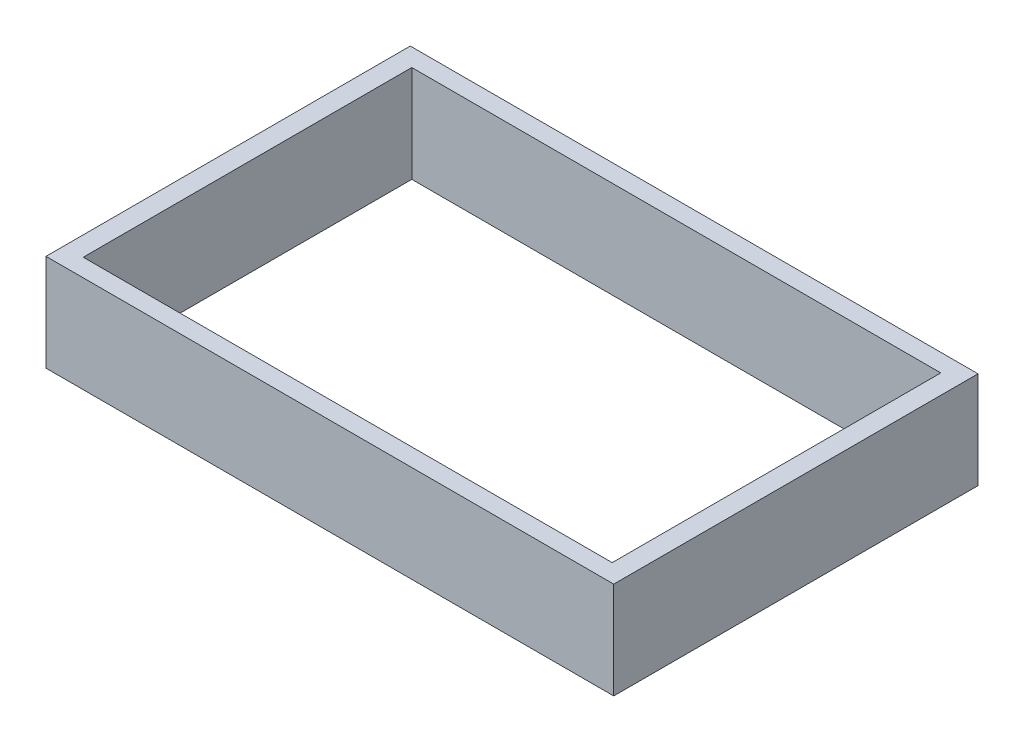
ISO-10303-21;
HEADER;
FILE_DESCRIPTION(('STEP AP214'),'2;1');
FILE_NAME('part.step','',(''),(''),'','','');
FILE_SCHEMA(('AUTOMOTIVE_DESIGN { 1 0 10303 214 1 1 1 1 }'));
ENDSEC;
DATA;
#1=APPLICATION_CONTEXT('core data for automotive mechanical design processes');
#2=APPLICATION_PROTOCOL_DEFINITION('international standard','automotive_design',2000,#1);
#3=PRODUCT_CONTEXT('',#1,'mechanical');
#4=PRODUCT('Part','Part','',(#3));
#5=PRODUCT_RELATED_PRODUCT_CATEGORY('part','',(#4));
#6=PRODUCT_DEFINITION_FORMATION('','',#4);
#7=PRODUCT_DEFINITION_CONTEXT('part definition',#1,'design');
#8=PRODUCT_DEFINITION('design','',#6,#7);
#9=PRODUCT_DEFINITION_SHAPE('','',#8);
#10=(LENGTH_UNIT() NAMED_UNIT(*) SI_UNIT(.MILLI.,.METRE.));
#11=(NAMED_UNIT(*) PLANE_ANGLE_UNIT() SI_UNIT($,.RADIAN.));
#12=(NAMED_UNIT(*) SI_UNIT($,.STERADIAN.) SOLID_ANGLE_UNIT());
#13=UNCERTAINTY_MEASURE_WITH_UNIT(LENGTH_MEASURE(1.E-05),#10,'distance_accuracy_value','');
#14=(GEOMETRIC_REPRESENTATION_CONTEXT(3) GLOBAL_UNCERTAINTY_ASSIGNED_CONTEXT((#13)) GLOBAL_UNIT_ASSIGNED_CONTEXT((#10,
#11,#12)) REPRESENTATION_CONTEXT('',''));
#15=CARTESIAN_POINT('',(0.,0.,0.));
#16=DIRECTION('',(0.,0.,1.));
#17=DIRECTION('',(1.,0.,0.));
#18=AXIS2_PLACEMENT_3D('',#15,#16,#17);
#19=CARTESIAN_POINT('',(0.,100.,0.));
#20=DIRECTION('',(0.,-1.,0.));
#21=DIRECTION('',(0.,0.,-1.));
#22=AXIS2_PLACEMENT_3D('',#19,#20,#21);
#23=PLANE('',#22);
#24=DIRECTION('',(0.,0.,-1.));
#25=VECTOR('',#24,1.);
#26=CARTESIAN_POINT('',(293.,100.,188.));
#27=LINE('',#26,#25);
#28=CARTESIAN_POINT('',(293.,100.,188.));
#29=VERTEX_POINT('',#28);
#30=CARTESIAN_POINT('',(293.,100.,-188.));
#31=VERTEX_POINT('',#30);
#32=EDGE_CURVE('E134',#29,#31,#27,.T.);
#33=ORIENTED_EDGE('',*,*,#32,.T.);
#34=DIRECTION('',(-1.,0.,0.));
#35=VECTOR('',#34,1.);
#36=CARTESIAN_POINT('',(-293.,100.,-188.));
#37=LINE('',#36,#35);
#38=CARTESIAN_POINT('',(-293.,100.,-188.));
#39=VERTEX_POINT('',#38);
#40=EDGE_CURVE('E137',#31,#39,#37,.T.);
#41=ORIENTED_EDGE('',*,*,#40,.T.);
#42=DIRECTION('',(0.,0.,1.));
#43=VECTOR('',#42,1.);
#44=CARTESIAN_POINT('',(-293.,100.,188.));
#45=LINE('',#44,#43);
#46=CARTESIAN_POINT('',(-293.,100.,188.));
#47=VERTEX_POINT('',#46);
#48=EDGE_CURVE('E140',#39,#47,#45,.T.);
#49=ORIENTED_EDGE('',*,*,#48,.T.);
#50=DIRECTION('',(1.,0.,0.));
#51=VECTOR('',#50,1.);
#52=CARTESIAN_POINT('',(-293.,100.,188.));
#53=LINE('',#52,#51);
#54=EDGE_CURVE('E142',#47,#29,#53,.T.);
#55=ORIENTED_EDGE('',*,*,#54,.T.);
#56=EDGE_LOOP('',(#33,#41,#49,#55));
#57=FACE_BOUND('',#56,.T.);
#58=DIRECTION('',(0.,0.,-1.));
#59=VECTOR('',#58,1.);
#60=CARTESIAN_POINT('',(273.,100.,169.575));
#61=LINE('',#60,#59);
#62=CARTESIAN_POINT('',(273.,100.,169.575));
#63=VERTEX_POINT('',#62);
#64=CARTESIAN_POINT('',(273.,100.,-169.575));
#65=VERTEX_POINT('',#64);
#66=EDGE_CURVE('E98',#63,#65,#61,.T.);
#67=ORIENTED_EDGE('',*,*,#66,.F.);
#68=DIRECTION('',(1.,0.,0.));
#69=VECTOR('',#68,1.);
#70=CARTESIAN_POINT('',(-273.,100.,169.575));
#71=LINE('',#70,#69);
#72=CARTESIAN_POINT('',(-273.,100.,169.575));
#73=VERTEX_POINT('',#72);
#74=EDGE_CURVE('E120',#73,#63,#71,.T.);
#75=ORIENTED_EDGE('',*,*,#74,.F.);
#76=DIRECTION('',(0.,0.,1.));
#77=VECTOR('',#76,1.);
#78=CARTESIAN_POINT('',(-273.,100.,169.575));
#79=LINE('',#78,#77);
#80=CARTESIAN_POINT('',(-273.,100.,-169.575));
#81=VERTEX_POINT('',#80);
#82=EDGE_CURVE('E118',#81,#73,#79,.T.);
#83=ORIENTED_EDGE('',*,*,#82,.F.);
#84=DIRECTION('',(-1.,0.,0.));
#85=VECTOR('',#84,1.);
#86=CARTESIAN_POINT('',(-273.,100.,-169.575));
#87=LINE('',#86,#85);
#88=EDGE_CURVE('E106',#65,#81,#87,.T.);
#89=ORIENTED_EDGE('',*,*,#88,.F.);
#90=EDGE_LOOP('',(#67,#75,#83,#89));
#91=FACE_BOUND('',#90,.T.);
#92=ADVANCED_FACE('F33',(#57,#91),#23,.F.);
#93=CARTESIAN_POINT('',(0.,0.,0.));
#94=DIRECTION('',(0.,-1.,0.));
#95=DIRECTION('',(0.,0.,-1.));
#96=AXIS2_PLACEMENT_3D('',#93,#94,#95);
#97=PLANE('',#96);
#98=DIRECTION('',(0.,0.,-1.));
#99=VECTOR('',#98,1.);
#100=CARTESIAN_POINT('',(293.,0.,188.));
#101=LINE('',#100,#99);
#102=CARTESIAN_POINT('',(293.,0.,188.));
#103=VERTEX_POINT('',#102);
#104=CARTESIAN_POINT('',(293.,0.,-188.));
#105=VERTEX_POINT('',#104);
#106=EDGE_CURVE('E114',#103,#105,#101,.T.);
#107=ORIENTED_EDGE('',*,*,#106,.F.);
#108=DIRECTION('',(1.,0.,0.));
#109=VECTOR('',#108,1.);
#110=CARTESIAN_POINT('',(-293.,0.,188.));
#111=LINE('',#110,#109);
#112=CARTESIAN_POINT('',(-293.,0.,188.));
#113=VERTEX_POINT('',#112);
#114=EDGE_CURVE('E138',#113,#103,#111,.T.);
#115=ORIENTED_EDGE('',*,*,#114,.F.);
#116=DIRECTION('',(0.,0.,1.));
#117=VECTOR('',#116,1.);
#118=CARTESIAN_POINT('',(-293.,0.,188.));
#119=LINE('',#118,#117);
#120=CARTESIAN_POINT('',(-293.,0.,-188.));
#121=VERTEX_POINT('',#120);
#122=EDGE_CURVE('E149',#121,#113,#119,.T.);
#123=ORIENTED_EDGE('',*,*,#122,.F.);
#124=DIRECTION('',(-1.,0.,0.));
#125=VECTOR('',#124,1.);
#126=CARTESIAN_POINT('',(-293.,0.,-188.));
#127=LINE('',#126,#125);
#128=EDGE_CURVE('E147',#105,#121,#127,.T.);
#129=ORIENTED_EDGE('',*,*,#128,.F.);
#130=EDGE_LOOP('',(#107,#115,#123,#129));
#131=FACE_BOUND('',#130,.T.);
#132=DIRECTION('',(1.,0.,0.));
#133=VECTOR('',#132,1.);
#134=CARTESIAN_POINT('',(-273.,0.,169.575));
#135=LINE('',#134,#133);
#136=CARTESIAN_POINT('',(-273.,0.,169.575));
#137=VERTEX_POINT('',#136);
#138=CARTESIAN_POINT('',(273.,0.,169.575));
#139=VERTEX_POINT('',#138);
#140=EDGE_CURVE('E107',#137,#139,#135,.T.);
#141=ORIENTED_EDGE('',*,*,#140,.T.);
#142=DIRECTION('',(0.,0.,-1.));
#143=VECTOR('',#142,1.);
#144=CARTESIAN_POINT('',(273.,0.,169.575));
#145=LINE('',#144,#143);
#146=CARTESIAN_POINT('',(273.,0.,-169.575));
#147=VERTEX_POINT('',#146);
#148=EDGE_CURVE('E56',#139,#147,#145,.T.);
#149=ORIENTED_EDGE('',*,*,#148,.T.);
#150=DIRECTION('',(-1.,0.,0.));
#151=VECTOR('',#150,1.);
#152=CARTESIAN_POINT('',(-273.,0.,-169.575));
#153=LINE('',#152,#151);
#154=CARTESIAN_POINT('',(-273.,0.,-169.575));
#155=VERTEX_POINT('',#154);
#156=EDGE_CURVE('E113',#147,#155,#153,.T.);
#157=ORIENTED_EDGE('',*,*,#156,.T.);
#158=DIRECTION('',(0.,0.,1.));
#159=VECTOR('',#158,1.);
#160=CARTESIAN_POINT('',(-273.,0.,169.575));
#161=LINE('',#160,#159);
#162=EDGE_CURVE('E126',#155,#137,#161,.T.);
#163=ORIENTED_EDGE('',*,*,#162,.T.);
#164=EDGE_LOOP('',(#141,#149,#157,#163));
#165=FACE_BOUND('',#164,.T.);
#166=ADVANCED_FACE('F167',(#131,#165),#97,.T.);
#167=CARTESIAN_POINT('',(293.,100.,188.));
#168=DIRECTION('',(-1.,0.,0.));
#169=DIRECTION('',(0.,0.,1.));
#170=AXIS2_PLACEMENT_3D('',#167,#168,#169);
#171=PLANE('',#170);
#172=ORIENTED_EDGE('',*,*,#106,.T.);
#173=DIRECTION('',(0.,-1.,0.));
#174=VECTOR('',#173,1.);
#175=CARTESIAN_POINT('',(293.,100.,-188.));
#176=LINE('',#175,#174);
#177=EDGE_CURVE('E11',#31,#105,#176,.T.);
#178=ORIENTED_EDGE('',*,*,#177,.F.);
#179=ORIENTED_EDGE('',*,*,#32,.F.);
#180=DIRECTION('',(0.,-1.,0.));
#181=VECTOR('',#180,1.);
#182=CARTESIAN_POINT('',(293.,100.,188.));
#183=LINE('',#182,#181);
#184=EDGE_CURVE('E144',#29,#103,#183,.T.);
#185=ORIENTED_EDGE('',*,*,#184,.T.);
#186=EDGE_LOOP('',(#172,#178,#179,#185));
#187=FACE_BOUND('',#186,.T.);
#188=ADVANCED_FACE('F35',(#187),#171,.F.);
#189=CARTESIAN_POINT('',(-293.,100.,-188.));
#190=DIRECTION('',(0.,0.,1.));
#191=DIRECTION('',(1.,0.,0.));
#192=AXIS2_PLACEMENT_3D('',#189,#190,#191);
#193=PLANE('',#192);
#194=ORIENTED_EDGE('',*,*,#128,.T.);
#195=DIRECTION('',(0.,-1.,0.));
#196=VECTOR('',#195,1.);
#197=CARTESIAN_POINT('',(-293.,100.,-188.));
#198=LINE('',#197,#196);
#199=EDGE_CURVE('E41',#39,#121,#198,.T.);
#200=ORIENTED_EDGE('',*,*,#199,.F.);
#201=ORIENTED_EDGE('',*,*,#40,.F.);
#202=ORIENTED_EDGE('',*,*,#177,.T.);
#203=EDGE_LOOP('',(#194,#200,#201,#202));
#204=FACE_BOUND('',#203,.T.);
#205=ADVANCED_FACE('F177',(#204),#193,.F.);
#206=CARTESIAN_POINT('',(-293.,100.,188.));
#207=DIRECTION('',(1.,0.,0.));
#208=DIRECTION('',(0.,0.,-1.));
#209=AXIS2_PLACEMENT_3D('',#206,#207,#208);
#210=PLANE('',#209);
#211=ORIENTED_EDGE('',*,*,#122,.T.);
#212=DIRECTION('',(0.,-1.,0.));
#213=VECTOR('',#212,1.);
#214=CARTESIAN_POINT('',(-293.,100.,188.));
#215=LINE('',#214,#213);
#216=EDGE_CURVE('E154',#47,#113,#215,.T.);
#217=ORIENTED_EDGE('',*,*,#216,.F.);
#218=ORIENTED_EDGE('',*,*,#48,.F.);
#219=ORIENTED_EDGE('',*,*,#199,.T.);
#220=EDGE_LOOP('',(#211,#217,#218,#219));
#221=FACE_BOUND('',#220,.T.);
#222=ADVANCED_FACE('F161',(#221),#210,.F.);
#223=CARTESIAN_POINT('',(-293.,100.,188.));
#224=DIRECTION('',(0.,0.,-1.));
#225=DIRECTION('',(-1.,0.,0.));
#226=AXIS2_PLACEMENT_3D('',#223,#224,#225);
#227=PLANE('',#226);
#228=ORIENTED_EDGE('',*,*,#114,.T.);
#229=ORIENTED_EDGE('',*,*,#184,.F.);
#230=ORIENTED_EDGE('',*,*,#54,.F.);
#231=ORIENTED_EDGE('',*,*,#216,.T.);
#232=EDGE_LOOP('',(#228,#229,#230,#231));
#233=FACE_BOUND('',#232,.T.);
#234=ADVANCED_FACE('F171',(#233),#227,.F.);
#235=CARTESIAN_POINT('',(273.,100.,169.575));
#236=DIRECTION('',(-1.,0.,0.));
#237=DIRECTION('',(0.,0.,1.));
#238=AXIS2_PLACEMENT_3D('',#235,#236,#237);
#239=PLANE('',#238);
#240=ORIENTED_EDGE('',*,*,#148,.F.);
#241=DIRECTION('',(0.,-1.,0.));
#242=VECTOR('',#241,1.);
#243=CARTESIAN_POINT('',(273.,100.,169.575));
#244=LINE('',#243,#242);
#245=EDGE_CURVE('E102',#63,#139,#244,.T.);
#246=ORIENTED_EDGE('',*,*,#245,.F.);
#247=ORIENTED_EDGE('',*,*,#66,.T.);
#248=DIRECTION('',(0.,-1.,0.));
#249=VECTOR('',#248,1.);
#250=CARTESIAN_POINT('',(273.,100.,-169.575));
#251=LINE('',#250,#249);
#252=EDGE_CURVE('E101',#65,#147,#251,.T.);
#253=ORIENTED_EDGE('',*,*,#252,.T.);
#254=EDGE_LOOP('',(#240,#246,#247,#253));
#255=FACE_BOUND('',#254,.T.);
#256=ADVANCED_FACE('F100',(#255),#239,.T.);
#257=CARTESIAN_POINT('',(-273.,100.,-169.575));
#258=DIRECTION('',(0.,0.,1.));
#259=DIRECTION('',(1.,0.,0.));
#260=AXIS2_PLACEMENT_3D('',#257,#258,#259);
#261=PLANE('',#260);
#262=ORIENTED_EDGE('',*,*,#156,.F.);
#263=ORIENTED_EDGE('',*,*,#252,.F.);
#264=ORIENTED_EDGE('',*,*,#88,.T.);
#265=DIRECTION('',(0.,-1.,0.));
#266=VECTOR('',#265,1.);
#267=CARTESIAN_POINT('',(-273.,100.,-169.575));
#268=LINE('',#267,#266);
#269=EDGE_CURVE('E115',#81,#155,#268,.T.);
#270=ORIENTED_EDGE('',*,*,#269,.T.);
#271=EDGE_LOOP('',(#262,#263,#264,#270));
#272=FACE_BOUND('',#271,.T.);
#273=ADVANCED_FACE('F110',(#272),#261,.T.);
#274=CARTESIAN_POINT('',(-273.,100.,169.575));
#275=DIRECTION('',(1.,0.,0.));
#276=DIRECTION('',(0.,0.,-1.));
#277=AXIS2_PLACEMENT_3D('',#274,#275,#276);
#278=PLANE('',#277);
#279=ORIENTED_EDGE('',*,*,#162,.F.);
#280=ORIENTED_EDGE('',*,*,#269,.F.);
#281=ORIENTED_EDGE('',*,*,#82,.T.);
#282=DIRECTION('',(0.,-1.,0.));
#283=VECTOR('',#282,1.);
#284=CARTESIAN_POINT('',(-273.,100.,169.575));
#285=LINE('',#284,#283);
#286=EDGE_CURVE('E48',#73,#137,#285,.T.);
#287=ORIENTED_EDGE('',*,*,#286,.T.);
#288=EDGE_LOOP('',(#279,#280,#281,#287));
#289=FACE_BOUND('',#288,.T.);
#290=ADVANCED_FACE('F200',(#289),#278,.T.);
#291=CARTESIAN_POINT('',(-273.,100.,169.575));
#292=DIRECTION('',(0.,0.,-1.));
#293=DIRECTION('',(-1.,0.,0.));
#294=AXIS2_PLACEMENT_3D('',#291,#292,#293);
#295=PLANE('',#294);
#296=ORIENTED_EDGE('',*,*,#140,.F.);
#297=ORIENTED_EDGE('',*,*,#286,.F.);
#298=ORIENTED_EDGE('',*,*,#74,.T.);
#299=ORIENTED_EDGE('',*,*,#245,.T.);
#300=EDGE_LOOP('',(#296,#297,#298,#299));
#301=FACE_BOUND('',#300,.T.);
#302=ADVANCED_FACE('F204',(#301),#295,.T.);
#303=CLOSED_SHELL('',(#92,#166,#188,#205,#222,#234,#256,#273,#290,#302));
#304=MANIFOLD_SOLID_BREP('B2',#303);
#305=ADVANCED_BREP_SHAPE_REPRESENTATION('',(#18,#304),#14);
#306=SHAPE_DEFINITION_REPRESENTATION(#9,#305);
ENDSEC;
END-ISO-10303-21;
